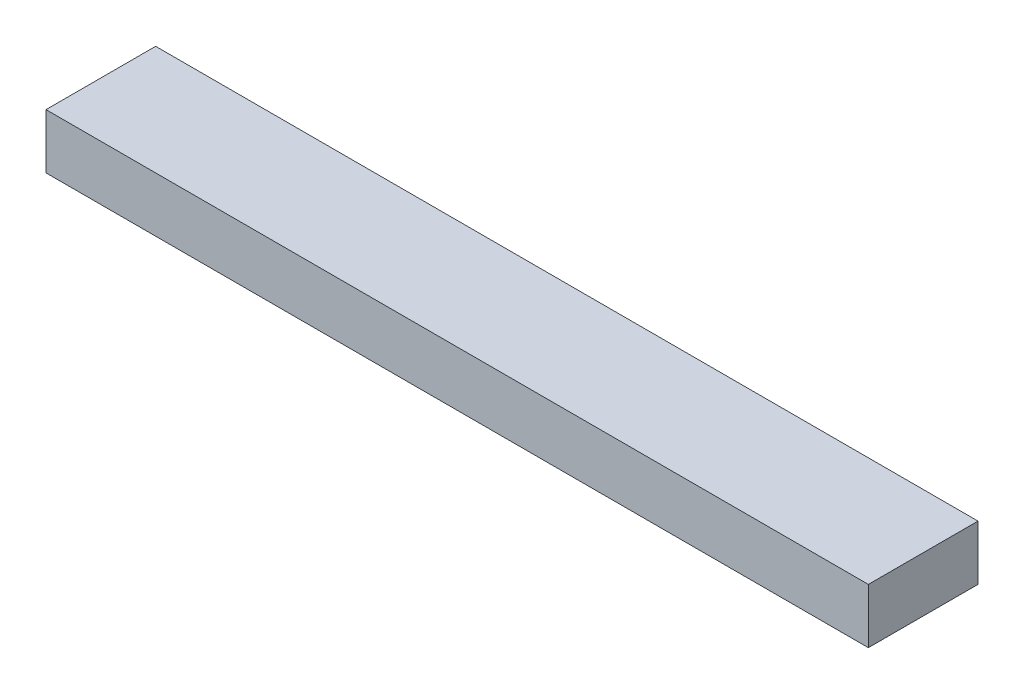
ISO-10303-21;
HEADER;
FILE_DESCRIPTION(('STEP AP214'),'2;1');
FILE_NAME('part.step','',(''),(''),'','','');
FILE_SCHEMA(('AUTOMOTIVE_DESIGN { 1 0 10303 214 1 1 1 1 }'));
ENDSEC;
DATA;
#1=APPLICATION_CONTEXT('core data for automotive mechanical design processes');
#2=APPLICATION_PROTOCOL_DEFINITION('international standard','automotive_design',2000,#1);
#3=PRODUCT_CONTEXT('',#1,'mechanical');
#4=PRODUCT('Part','Part','',(#3));
#5=PRODUCT_RELATED_PRODUCT_CATEGORY('part','',(#4));
#6=PRODUCT_DEFINITION_FORMATION('','',#4);
#7=PRODUCT_DEFINITION_CONTEXT('part definition',#1,'design');
#8=PRODUCT_DEFINITION('design','',#6,#7);
#9=PRODUCT_DEFINITION_SHAPE('','',#8);
#10=(LENGTH_UNIT() NAMED_UNIT(*) SI_UNIT(.MILLI.,.METRE.));
#11=(NAMED_UNIT(*) PLANE_ANGLE_UNIT() SI_UNIT($,.RADIAN.));
#12=(NAMED_UNIT(*) SI_UNIT($,.STERADIAN.) SOLID_ANGLE_UNIT());
#13=UNCERTAINTY_MEASURE_WITH_UNIT(LENGTH_MEASURE(1.E-05),#10,'distance_accuracy_value','');
#14=(GEOMETRIC_REPRESENTATION_CONTEXT(3) GLOBAL_UNCERTAINTY_ASSIGNED_CONTEXT((#13)) GLOBAL_UNIT_ASSIGNED_CONTEXT((#10,
#11,#12)) REPRESENTATION_CONTEXT('',''));
#15=CARTESIAN_POINT('',(0.,0.,0.));
#16=DIRECTION('',(0.,0.,1.));
#17=DIRECTION('',(1.,0.,0.));
#18=AXIS2_PLACEMENT_3D('',#15,#16,#17);
#19=CARTESIAN_POINT('',(750.,-25.,-50.));
#20=DIRECTION('',(0.,0.,1.));
#21=DIRECTION('',(1.,0.,0.));
#22=AXIS2_PLACEMENT_3D('',#19,#20,#21);
#23=PLANE('',#22);
#24=DIRECTION('',(0.,1.,0.));
#25=VECTOR('',#24,1.);
#26=CARTESIAN_POINT('',(0.,-25.,-50.));
#27=LINE('',#26,#25);
#28=CARTESIAN_POINT('',(0.,-25.,-50.));
#29=VERTEX_POINT('',#28);
#30=CARTESIAN_POINT('',(0.,25.,-50.));
#31=VERTEX_POINT('',#30);
#32=EDGE_CURVE('E102',#29,#31,#27,.T.);
#33=ORIENTED_EDGE('',*,*,#32,.T.);
#34=DIRECTION('',(-1.,0.,0.));
#35=VECTOR('',#34,1.);
#36=CARTESIAN_POINT('',(750.,25.,-50.));
#37=LINE('',#36,#35);
#38=CARTESIAN_POINT('',(750.,25.,-50.));
#39=VERTEX_POINT('',#38);
#40=EDGE_CURVE('E11',#39,#31,#37,.T.);
#41=ORIENTED_EDGE('',*,*,#40,.F.);
#42=DIRECTION('',(0.,1.,0.));
#43=VECTOR('',#42,1.);
#44=CARTESIAN_POINT('',(750.,-25.,-50.));
#45=LINE('',#44,#43);
#46=CARTESIAN_POINT('',(750.,-25.,-50.));
#47=VERTEX_POINT('',#46);
#48=EDGE_CURVE('E90',#47,#39,#45,.T.);
#49=ORIENTED_EDGE('',*,*,#48,.F.);
#50=DIRECTION('',(-1.,0.,0.));
#51=VECTOR('',#50,1.);
#52=CARTESIAN_POINT('',(750.,-25.,-50.));
#53=LINE('',#52,#51);
#54=EDGE_CURVE('E98',#47,#29,#53,.T.);
#55=ORIENTED_EDGE('',*,*,#54,.T.);
#56=EDGE_LOOP('',(#33,#41,#49,#55));
#57=FACE_BOUND('',#56,.T.);
#58=ADVANCED_FACE('F39',(#57),#23,.F.);
#59=CARTESIAN_POINT('',(750.,25.,50.));
#60=DIRECTION('',(0.,-1.,0.));
#61=DIRECTION('',(0.,0.,-1.));
#62=AXIS2_PLACEMENT_3D('',#59,#60,#61);
#63=PLANE('',#62);
#64=DIRECTION('',(0.,0.,1.));
#65=VECTOR('',#64,1.);
#66=CARTESIAN_POINT('',(0.,25.,50.));
#67=LINE('',#66,#65);
#68=CARTESIAN_POINT('',(0.,25.,50.));
#69=VERTEX_POINT('',#68);
#70=EDGE_CURVE('E94',#31,#69,#67,.T.);
#71=ORIENTED_EDGE('',*,*,#70,.T.);
#72=DIRECTION('',(-1.,0.,0.));
#73=VECTOR('',#72,1.);
#74=CARTESIAN_POINT('',(750.,25.,50.));
#75=LINE('',#74,#73);
#76=CARTESIAN_POINT('',(750.,25.,50.));
#77=VERTEX_POINT('',#76);
#78=EDGE_CURVE('E47',#77,#69,#75,.T.);
#79=ORIENTED_EDGE('',*,*,#78,.F.);
#80=DIRECTION('',(0.,0.,1.));
#81=VECTOR('',#80,1.);
#82=CARTESIAN_POINT('',(750.,25.,50.));
#83=LINE('',#82,#81);
#84=EDGE_CURVE('E85',#39,#77,#83,.T.);
#85=ORIENTED_EDGE('',*,*,#84,.F.);
#86=ORIENTED_EDGE('',*,*,#40,.T.);
#87=EDGE_LOOP('',(#71,#79,#85,#86));
#88=FACE_BOUND('',#87,.T.);
#89=ADVANCED_FACE('F93',(#88),#63,.F.);
#90=CARTESIAN_POINT('',(750.,-25.,50.));
#91=DIRECTION('',(0.,0.,-1.));
#92=DIRECTION('',(-1.,0.,0.));
#93=AXIS2_PLACEMENT_3D('',#90,#91,#92);
#94=PLANE('',#93);
#95=DIRECTION('',(0.,-1.,0.));
#96=VECTOR('',#95,1.);
#97=CARTESIAN_POINT('',(0.,-25.,50.));
#98=LINE('',#97,#96);
#99=CARTESIAN_POINT('',(0.,-25.,50.));
#100=VERTEX_POINT('',#99);
#101=EDGE_CURVE('E72',#69,#100,#98,.T.);
#102=ORIENTED_EDGE('',*,*,#101,.T.);
#103=DIRECTION('',(-1.,0.,0.));
#104=VECTOR('',#103,1.);
#105=CARTESIAN_POINT('',(750.,-25.,50.));
#106=LINE('',#105,#104);
#107=CARTESIAN_POINT('',(750.,-25.,50.));
#108=VERTEX_POINT('',#107);
#109=EDGE_CURVE('E95',#108,#100,#106,.T.);
#110=ORIENTED_EDGE('',*,*,#109,.F.);
#111=DIRECTION('',(0.,-1.,0.));
#112=VECTOR('',#111,1.);
#113=CARTESIAN_POINT('',(750.,-25.,50.));
#114=LINE('',#113,#112);
#115=EDGE_CURVE('E88',#77,#108,#114,.T.);
#116=ORIENTED_EDGE('',*,*,#115,.F.);
#117=ORIENTED_EDGE('',*,*,#78,.T.);
#118=EDGE_LOOP('',(#102,#110,#116,#117));
#119=FACE_BOUND('',#118,.T.);
#120=ADVANCED_FACE('F96',(#119),#94,.F.);
#121=CARTESIAN_POINT('',(750.,-25.,50.));
#122=DIRECTION('',(0.,1.,0.));
#123=DIRECTION('',(0.,0.,1.));
#124=AXIS2_PLACEMENT_3D('',#121,#122,#123);
#125=PLANE('',#124);
#126=DIRECTION('',(0.,0.,-1.));
#127=VECTOR('',#126,1.);
#128=CARTESIAN_POINT('',(0.,-25.,50.));
#129=LINE('',#128,#127);
#130=EDGE_CURVE('E78',#100,#29,#129,.T.);
#131=ORIENTED_EDGE('',*,*,#130,.T.);
#132=ORIENTED_EDGE('',*,*,#54,.F.);
#133=DIRECTION('',(0.,0.,-1.));
#134=VECTOR('',#133,1.);
#135=CARTESIAN_POINT('',(750.,-25.,50.));
#136=LINE('',#135,#134);
#137=EDGE_CURVE('E55',#108,#47,#136,.T.);
#138=ORIENTED_EDGE('',*,*,#137,.F.);
#139=ORIENTED_EDGE('',*,*,#109,.T.);
#140=EDGE_LOOP('',(#131,#132,#138,#139));
#141=FACE_BOUND('',#140,.T.);
#142=ADVANCED_FACE('F109',(#141),#125,.F.);
#143=CARTESIAN_POINT('',(750.,0.,0.));
#144=DIRECTION('',(-1.,0.,0.));
#145=DIRECTION('',(0.,0.,1.));
#146=AXIS2_PLACEMENT_3D('',#143,#144,#145);
#147=PLANE('',#146);
#148=ORIENTED_EDGE('',*,*,#48,.T.);
#149=ORIENTED_EDGE('',*,*,#84,.T.);
#150=ORIENTED_EDGE('',*,*,#115,.T.);
#151=ORIENTED_EDGE('',*,*,#137,.T.);
#152=EDGE_LOOP('',(#148,#149,#150,#151));
#153=FACE_BOUND('',#152,.T.);
#154=ADVANCED_FACE('F86',(#153),#147,.F.);
#155=CARTESIAN_POINT('',(0.,0.,0.));
#156=DIRECTION('',(-1.,0.,0.));
#157=DIRECTION('',(0.,0.,1.));
#158=AXIS2_PLACEMENT_3D('',#155,#156,#157);
#159=PLANE('',#158);
#160=ORIENTED_EDGE('',*,*,#32,.F.);
#161=ORIENTED_EDGE('',*,*,#130,.F.);
#162=ORIENTED_EDGE('',*,*,#101,.F.);
#163=ORIENTED_EDGE('',*,*,#70,.F.);
#164=EDGE_LOOP('',(#160,#161,#162,#163));
#165=FACE_BOUND('',#164,.T.);
#166=ADVANCED_FACE('F112',(#165),#159,.T.);
#167=CLOSED_SHELL('',(#58,#89,#120,#142,#154,#166));
#168=MANIFOLD_SOLID_BREP('B2',#167);
#169=ADVANCED_BREP_SHAPE_REPRESENTATION('',(#18,#168),#14);
#170=SHAPE_DEFINITION_REPRESENTATION(#9,#169);
ENDSEC;
END-ISO-10303-21;
